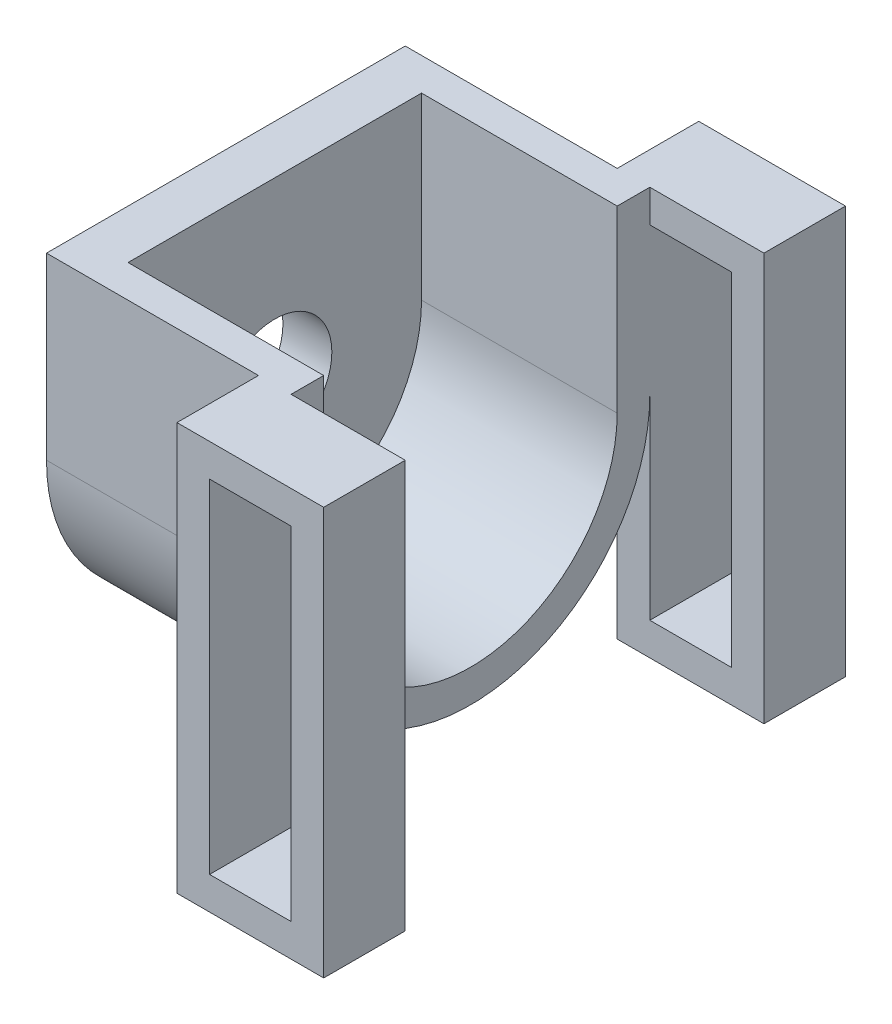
from build123d import *

# Parameters (mm, degrees)
BOSS_EXTRUDE2_DEPTH = 15
CUT_EXTRUDE1_DEPTH  = 12
SKETCH3_R           = 3.5
CUT_EXTRUDE2_DEPTH  = 20.646882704
SKETCH4_W           = 2
SKETCH4_H           = 11
BOSS_EXTRUDE3_DEPTH = 5
SKETCH6_W           = 2
SKETCH6_H           = 5
BOSS_EXTRUDE4_DEPTH = 14
SKETCH7_W           = 5
SKETCH7_H           = 25
BOSS_EXTRUDE5_DEPTH = 7
SKETCH8_W           = 2
SKETCH8_H           = 11
BOSS_EXTRUDE6_DEPTH = 5
SKETCH9_W           = 2
SKETCH9_H           = 5
BOSS_EXTRUDE7_DEPTH = 14
SKETCH10_W          = 5
SKETCH10_H          = 25
BOSS_EXTRUDE8_DEPTH = 7
SKETCH11_W          = 5
SKETCH11_H          = 21
CUT_EXTRUDE3_DEPTH  = 42.279534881


with BuildPart() as part:
    # Sketch1 → Boss-Extrude2 (new body)
    with BuildSketch(Plane(origin=(0, 0, 0), x_dir=(0, 0, -1), z_dir=(1, 0, 0))):
        with BuildLine():
            Line((-11, 0), (-11, 11))
            Line((-11, 11), (11, 11))
            Line((11, 11), (11, 0))
            ThreePointArc((11, 0), (0, -11), (-11, 0))
        make_face()
    extrude(amount=BOSS_EXTRUDE2_DEPTH)

    # Sketch2 → Cut-Extrude1 (cut)
    with BuildSketch(Plane(origin=(15, 0, 0), x_dir=(0, 0, -1), z_dir=(1, 0, 0))):
        with BuildLine():
            Line((-9, 0), (-9, 11))
            Line((-9, 11), (9, 11))
            Line((9, 11), (9, 0))
            ThreePointArc((9, 0), (0, -9), (-9, 0))
        make_face()
    extrude(amount=-CUT_EXTRUDE1_DEPTH, mode=Mode.SUBTRACT)

    # Sketch3 → Cut-Extrude2 (cut, through all)
    with BuildSketch(Plane(origin=(3, 0, 0), x_dir=(0, 0, -1), z_dir=(1, 0, 0))):
        Circle(SKETCH3_R)
    extrude(amount=-CUT_EXTRUDE2_DEPTH, mode=Mode.SUBTRACT)

    # Sketch4 → Boss-Extrude3 (add)
    with BuildSketch(Plane(origin=(0, 0, -11), x_dir=(-1, 0, 0), z_dir=(0, 0, -1))):
        with Locations((-14, 5.5)):
            Rectangle(SKETCH4_W, SKETCH4_H)
    extrude(amount=BOSS_EXTRUDE3_DEPTH)

    # Sketch6 → Boss-Extrude4 (add)
    with BuildSketch(Plane.XZ):
        with Locations((14, -13.5)):
            Rectangle(SKETCH6_W, SKETCH6_H)
    extrude(amount=BOSS_EXTRUDE4_DEPTH)

    # Sketch7 → Boss-Extrude5 (add)
    with BuildSketch(Plane(origin=(15, 0, 0), x_dir=(0, 0, -1), z_dir=(1, 0, 0))):
        with Locations((13.5, -1.5)):
            Rectangle(SKETCH7_W, SKETCH7_H)
    extrude(amount=BOSS_EXTRUDE5_DEPTH)

    # Sketch8 → Boss-Extrude6 (add)
    with BuildSketch(Plane.XY.offset(11)):
        with Locations((14, 5.5)):
            Rectangle(SKETCH8_W, SKETCH8_H)
    extrude(amount=BOSS_EXTRUDE6_DEPTH)

    # Sketch9 → Boss-Extrude7 (add)
    with BuildSketch(Plane.XZ):
        with Locations((14, 13.5)):
            Rectangle(SKETCH9_W, SKETCH9_H)
    extrude(amount=BOSS_EXTRUDE7_DEPTH)

    # Sketch10 → Boss-Extrude8 (add)
    with BuildSketch(Plane(origin=(15, 0, 0), x_dir=(0, 0, -1), z_dir=(1, 0, 0))):
        with Locations((-13.5, -1.5)):
            Rectangle(SKETCH10_W, SKETCH10_H)
    extrude(amount=BOSS_EXTRUDE8_DEPTH)

    # Sketch11 → Cut-Extrude3 (cut, through all)
    with BuildSketch(Plane.XY.offset(16)):
        with Locations((17.5, -1.5)):
            Rectangle(SKETCH11_W, SKETCH11_H)
    extrude(amount=-CUT_EXTRUDE3_DEPTH, mode=Mode.SUBTRACT)


solid = part.part
